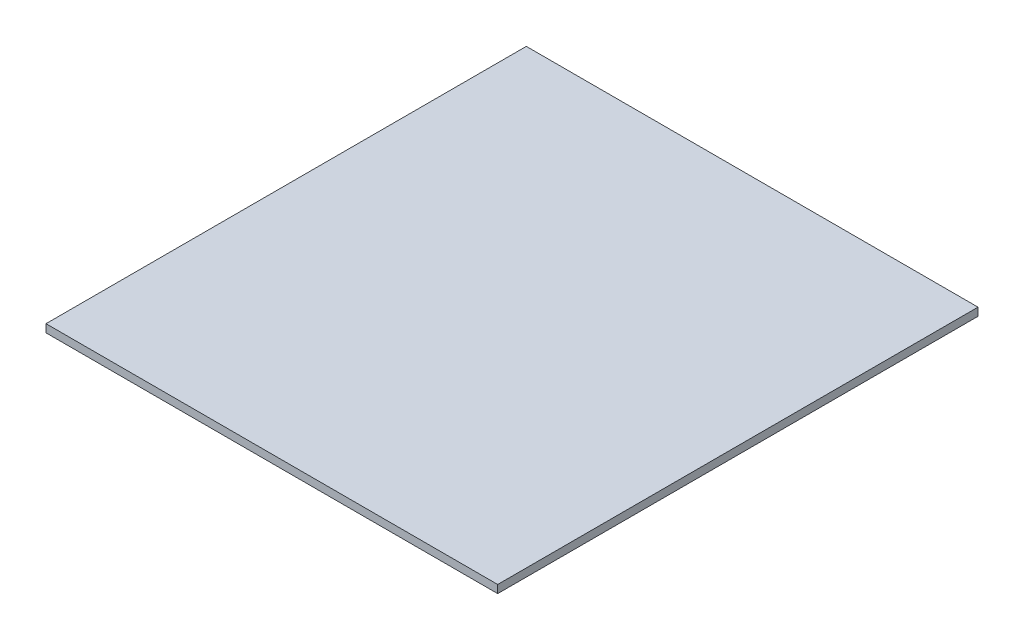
from build123d import *

# Parameters (mm, degrees)
SKETCH1_W      = 90.17
SKETCH1_H      = 95.885
EXTRUDE1_DEPTH = 1.5875


with BuildPart() as part:
    # Sketch1 → Extrude1 (new body)
    with BuildSketch(Plane(origin=(0, 0, 0), x_dir=(1, 0, 0), z_dir=(0, 1, 0))):
        with Locations((45.085, 47.9425)):
            Rectangle(SKETCH1_W, SKETCH1_H)
    extrude(amount=EXTRUDE1_DEPTH)


solid = part.part
